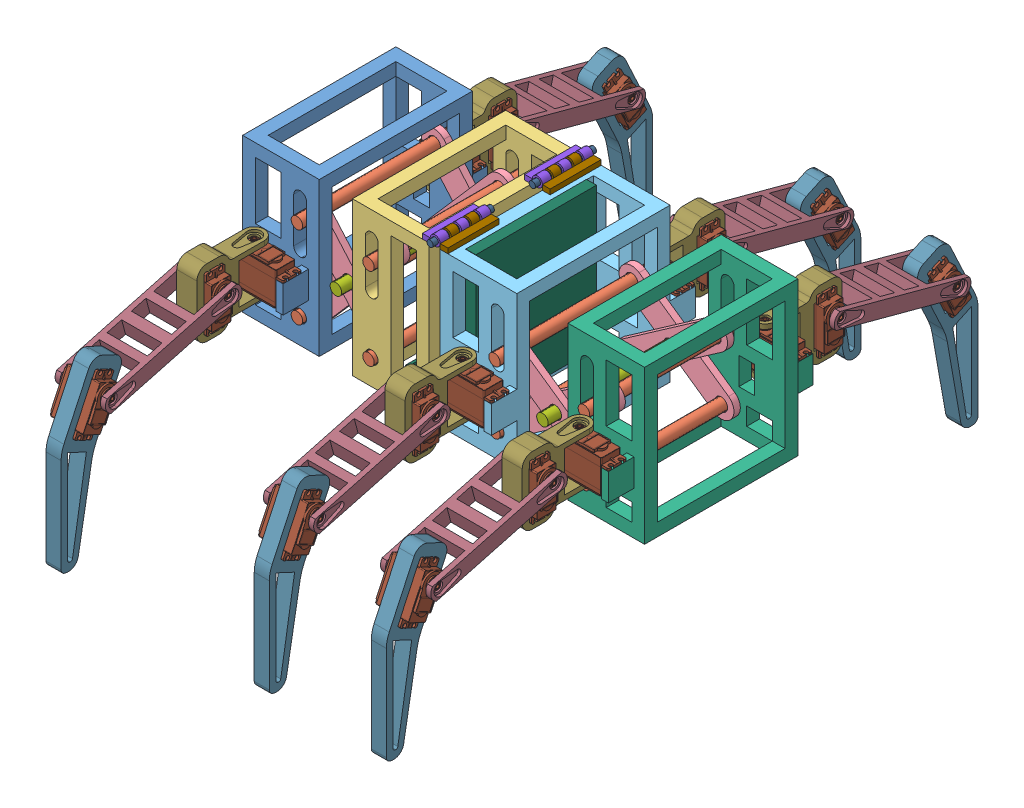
SolidWorks assembly Small-Scale Model Assembly (4-22-21).SLDASM, configuration Default (file format 13000). Lengths in mm.
Overall size (399.66 265.25 667.73).
65 component instances, 15 part files, 181 mates.
Components (placement in the parent):
- Left Body Segment-1: Left Body Segment.SLDPRT [Default] at (-103.1235 37.0795 149.1921) size (76.2 152.4 203.2)
- Shafts for Scissor Lift-1: Shafts for Scissor Lift.SLDPRT [Default] at (-45.9735 144.3276 224.7671) size (11.43 11.43 160)
- Shafts for Scissor Lift-2: Shafts for Scissor Lift.SLDPRT [Default] at (25.1885 144.3276 224.7671) size (11.43 11.43 160)
- Middle Left Body Segment-1: Middle Left Body Segment.SLDPRT [Default] at (6.1385 37.0795 149.1921) size (76.2 152.4 152.4)
- Shafts for Scissor Lift-3: Shafts for Scissor Lift.SLDPRT [Default] at (25.1885 62.4795 224.7671) size (11.43 11.43 160)
- Shafts for Scissor Lift-4: Shafts for Scissor Lift.SLDPRT [Default] at (-45.9735 62.4795 224.7671) size (11.43 11.43 160)
- Arms for Scissor Lift-1: Arms for Scissor Lift.SLDPRT [Default] at (-45.9735 144.3276 282.5421) x (0.656125 -0.754652 0) z (0 0 1) size (133.86 25.4 6.35)
- Arms for Scissor Lift-2: Arms for Scissor Lift.SLDPRT [Default] at (-45.9735 62.4795 276.1921) x (0.656125 0.754652 0) z (0 0 1) size (133.86 25.4 6.35)
- Arms for Scissor Lift-3: Arms for Scissor Lift.SLDPRT [Default] at (-45.9735 144.3276 161.8921) x (0.656125 -0.754652 0) z (0 0 1) size (133.86 25.4 6.35)
- Arms for Scissor Lift-4: Arms for Scissor Lift.SLDPRT [Default] at (-45.9735 62.4795 168.2421) x (0.656125 0.754652 0) z (0 0 1) size (133.86 25.4 6.35)
- Middle right Body Segment-1: Middle right Body Segment.SLDPRT [Default] at (93.3385 37.0795 149.1921) size (76.2 152.4 203.2)
- Right Body Segment-1: Right Body Segment.SLDPRT [Default] at (296.5385 37.0795 301.5921) x (-1 0 0) z (0 0 -1) size (76.2 152.4 203.2)
- Shafts for Scissor Lift-5: Shafts for Scissor Lift.SLDPRT [Default] at (239.3885 62.4795 224.7671) size (11.43 11.43 160)
- Shafts for Scissor Lift-6: Shafts for Scissor Lift.SLDPRT [Default] at (150.4885 62.4795 224.7671) size (11.43 11.43 160)
- Shafts for Scissor Lift-7: Shafts for Scissor Lift.SLDPRT [Default] at (239.3885 124.6078 224.7671) size (11.43 11.43 160)
- Shafts for Scissor Lift-8: Shafts for Scissor Lift.SLDPRT [Default] at (150.4885 124.6078 224.7671) size (11.43 11.43 160)
- Arms for Scissor Lift-5: Arms for Scissor Lift.SLDPRT [Default] at (150.4885 124.6078 282.5421) x (0.819672 -0.572833 0) z (0 0 1) size (133.86 25.4 6.35)
- Arms for Scissor Lift-6: Arms for Scissor Lift.SLDPRT [Default] at (150.4885 62.4795 276.1921) x (0.819672 0.572833 0) z (0 0 1) size (133.86 25.4 6.35)
- Arms for Scissor Lift-7: Arms for Scissor Lift.SLDPRT [Default] at (150.4885 124.6078 161.8921) x (0.819672 -0.572833 0) z (0 0 1) size (133.86 25.4 6.35)
- Arms for Scissor Lift-8: Arms for Scissor Lift.SLDPRT [Default] at (150.4885 62.4795 168.2421) x (0.819672 0.572833 0) z (0 0 1) size (133.86 25.4 6.35)
- Shaft for middle of Scissor Lift-1: Shaft for middle of Scissor Lift.SLDPRT [Default] at (-10.3925 103.4036 151.5921) size (11.43 11.43 150)
- Shaft for middle of Scissor Lift-2: Shaft for middle of Scissor Lift.SLDPRT [Default] at (194.9385 93.5437 151.5921) size (11.43 11.43 150)
- Hinge-1: Hinge.SLDPRT [InnerCuts] at (75.6385 189.4795 276.1921) x (0 1 0) z (0 0 -1) size (10 17.7 50.8)
- Hinge-2: Hinge.SLDPRT [InnerCuts] at (75.6385 189.4795 174.5921) x (0 1 0) z (0 0 -1) size (10 17.7 50.8)
- Hinge 2-1: Hinge 2.SLDPRT [InnerCuts] at (101.0385 189.4795 174.5921) x (0 1 0) z (0 0 1) size (10 17.7 50.8)
- Hinge 2-2: Hinge 2.SLDPRT [InnerCuts] at (101.0385 189.4795 276.1921) x (0 1 0) z (0 0 1) size (10 17.7 50.8)
- Hinge Pin-1: Hinge Pin.SLDPRT [Default] at (88.3385 194.4795 276.2721) size (6.3 6.3 60.8)
- Hinge Pin-2: Hinge Pin.SLDPRT [Default] at (88.3385 194.4795 174.6721) size (6.3 6.3 60.8)
- servo-1: servo.SLDPRT [Default] at (149.3772 57.1295 133.5765) x (1 0 0) z (0 1 0) size (54 19 42.15)
- servo-2: servo.SLDPRT [Default] at (-57.6598 57.1295 317.7765) x (1 0 0) z (0 1 0) size (54 19 42.15)
- servo-3: servo.SLDPRT [Default] at (91.3885 93.2408 83.0265) x (0 -1 0) z (1 0 0) size (54 19 42.15)
- servo-4: servo.SLDPRT [Default] at (207.8135 93.2408 83.0265) x (0 -1 0) z (1 0 0) size (54 19 42.15)
- servo-5: servo.SLDPRT [Default] at (-115.6485 93.2408 83.0265) x (0 -1 0) z (1 0 0) size (54 19 42.15)
- servo-6: servo.SLDPRT [Default] at (207.8135 93.2408 368.3265) x (0 -1 0) z (1 0 0) size (54 19 42.15)
- servo-7: servo.SLDPRT [Default] at (-57.6598 57.1295 133.5765) x (1 0 0) z (0 1 0) size (54 19 42.15)
- servo-8: servo.SLDPRT [Default] at (265.8022 57.1295 133.5765) x (1 0 0) z (0 1 0) size (54 19 42.15)
- servo-9: servo.SLDPRT [Default] at (149.3772 57.1295 317.7765) x (1 0 0) z (0 1 0) size (54 19 42.15)
- servo-10: servo.SLDPRT [Default] at (265.8022 57.1295 317.7765) x (1 0 0) z (0 1 0) size (54 19 42.15)
- Segment 1-1: Segment 1.SLDPRT [Default] at (237.7635 100.6045 349.9921) x (0 -1 0) z (1 0 0) size (67 77 20)
- Segment 1-2: Segment 1.SLDPRT [Default] at (-65.6985 100.6045 100.7921) x (0 -1 0) z (-1 0 0) size (67 77 20)
- Segment 1-3: Segment 1.SLDPRT [Default] at (-85.6985 100.6045 349.9921) x (0 -1 0) z (1 0 0) size (67 77 20)
- Segment 1-4: Segment 1.SLDPRT [Default] at (141.3385 100.6045 100.7921) x (0 -1 0) z (-1 0 0) size (67 77 20)
- Segment 1-5: Segment 1.SLDPRT [Default] at (121.3385 100.6045 349.9921) x (0 -1 0) z (1 0 0) size (67 77 20)
- Segment 1-6: Segment 1.SLDPRT [Default] at (257.7635 100.6045 100.7921) x (0 -1 0) z (-1 0 0) size (67 77 20)
- servo-11: servo.SLDPRT [Default] at (91.3885 93.2408 368.3265) x (0 -1 0) z (1 0 0) size (54 19 42.15)
- servo-12: servo.SLDPRT [Default] at (-115.6485 93.2408 368.3265) x (0 -1 0) z (1 0 0) size (54 19 42.15)
- Segment 2-1: Segment 2.SLDPRT [Default] at (-72.1735 88.5059 424.0565) x (1 0 0) z (0 0.965926 0.258819) size (50.02 140 15)
- Segment 2-2: Segment 2.SLDPRT [Default] at (134.8635 88.5059 424.0565) x (1 0 0) z (0 0.965926 0.258819) size (50.02 140 15)
- Segment 2-3: Segment 2.SLDPRT [Default] at (251.2885 88.5059 424.0565) x (1 0 0) z (0 0.965926 0.258819) size (50.02 140 15)
- Segment 2-4: Segment 2.SLDPRT [Default] at (-72.1735 102.9948 22.8454) x (1 0 0) z (0 -0.965926 0.258819) size (50.02 140 15)
- Segment 2-5: Segment 2.SLDPRT [Default] at (134.8635 102.9948 22.8454) x (1 0 0) z (0 -0.965926 0.258819) size (50.02 140 15)
- Segment 2-6: Segment 2.SLDPRT [Default] at (251.2885 102.9948 22.8454) x (1 0 0) z (0 -0.965926 0.258819) size (50.02 140 15)
- servo-17: servo.SLDPRT [Default] at (91.3885 63.9928 491.8345) x (0 -0.906308 0.422618) z (1 0 0) size (54 19 42.15)
- servo-18: servo.SLDPRT [Default] at (-115.6485 63.9928 491.8345) x (0 -0.906308 0.422618) z (1 0 0) size (54 19 42.15)
- servo-19: servo.SLDPRT [Default] at (207.8135 63.7524 -40.5347) x (0 -0.906308 -0.422618) z (1 0 0) size (54 19 42.15)
- servo-20: servo.SLDPRT [Default] at (91.3885 63.7524 -40.5347) x (0 -0.906308 -0.422618) z (1 0 0) size (54 19 42.15)
- servo-21: servo.SLDPRT [Default] at (207.8135 63.9928 491.8345) x (0 -0.906308 0.422618) z (1 0 0) size (54 19 42.15)
- servo-22: servo.SLDPRT [Default] at (-115.6485 63.7524 -40.5347) x (0 -0.906308 -0.422618) z (1 0 0) size (54 19 42.15)
- Segment 3-1: Segment 3.SLDPRT [Default] at (-80.6985 70.2294 487.7849) x (0 -0.422618 -0.906308) z (1 0 0) size (57.13 169.08 15)
- Segment 3-2: Segment 3.SLDPRT [Default] at (126.3385 70.2294 487.7849) x (0 -0.422618 -0.906308) z (1 0 0) size (57.13 169.08 15)
- Segment 3-3: Segment 3.SLDPRT [Default] at (242.7635 70.2294 487.7849) x (0 -0.422618 -0.906308) z (1 0 0) size (57.13 169.08 15)
- Segment 3-4: Segment 3.SLDPRT [Default] at (257.7635 70.2294 -37.0007) x (0 -0.422618 0.906308) z (-1 0 0) size (57.13 169.08 15)
- Segment 3-5: Segment 3.SLDPRT [Default] at (141.3385 70.2294 -37.0007) x (0 -0.422618 0.906308) z (-1 0 0) size (57.13 169.08 15)
- Segment 3-6: Segment 3.SLDPRT [Default] at (-65.6985 70.2294 -37.0007) x (0 -0.422618 0.906308) z (-1 0 0) size (57.13 169.08 15)
- Arduino and breadboard mount-1: Arduino and breadboard mount.SLDPRT [Default] at (116.0385 49.7795 168.8921) x (0 0 1) z (-1 0 0) size (120 140 70)
Mates (geometry in assembly coordinates):
- Slot1: slot anti-aligned: cylinder of Shafts for Scissor Lift-1 through (-45.9735 144.3276 304.7671) axis (0 0 -1) radius 5.715; plane of Left Body Segment-1 through (-52.3235 164.0795 123.7921) normal (1 0 0); cylinder of Left Body Segment-1 through (-45.9735 164.0795 123.7921) axis (0 0 1) radius 6.35
- Distance1: distance = 3.175 mm aligned: plane of Shafts for Scissor Lift-1 through (-45.9735 144.3276 304.7671) normal (0 0 1); plane of Left Body Segment-1 through (-103.1235 37.0795 301.5921) normal (0 0 1)
- Slot2: slot anti-aligned: cylinder of Shafts for Scissor Lift-2 through (25.1885 144.3276 304.7671) axis (0 0 -1) radius 5.715; plane of Middle Left Body Segment-1 through (18.8385 164.0795 149.1921) normal (1 0 0); cylinder of Middle Left Body Segment-1 through (25.1885 164.0795 149.1921) axis (0 0 1) radius 6.35
- Distance2: distance = 3.175 mm aligned: plane of Middle Left Body Segment-1 through (6.1385 37.0795 301.5921) normal (0 0 1); plane of Shafts for Scissor Lift-2 through (25.1885 144.3276 304.7671) normal (0 0 1)
- Coincident1: coincident aligned: plane of Left Body Segment-1 through (-103.1235 37.0795 301.5921) normal (0 0 1); plane of Middle Left Body Segment-1 through (6.1385 37.0795 301.5921) normal (0 0 1)
- Coincident2: coincident aligned: plane of Left Body Segment-1 through (-103.1235 189.4795 301.5921) normal (0 1 0); plane of Middle Left Body Segment-1 through (6.1385 189.4795 301.5921) normal (0 1 0)
- Coincident3: coincident anti-aligned: line of Left Body Segment-1 through (-45.9735 62.4795 288.8921) axis (0 0 1); line of Shafts for Scissor Lift-4 through (-45.9735 62.4795 304.7671) axis (0 0 -1)
- Distance3: distance = 3.175 mm aligned: plane of Shafts for Scissor Lift-4 through (-45.9735 62.4795 304.7671) normal (0 0 1); plane of Left Body Segment-1 through (-103.1235 37.0795 301.5921) normal (0 0 1)
- Coincident5: coincident anti-aligned: line of Middle Left Body Segment-1 through (25.1885 62.4795 288.8921) axis (0 0 1); line of Shafts for Scissor Lift-3 through (25.1885 62.4795 304.7671) axis (0 0 -1)
- Distance4: distance = 3.175 mm aligned: plane of Shafts for Scissor Lift-3 through (25.1885 62.4795 304.7671) normal (0 0 1); plane of Middle Left Body Segment-1 through (6.1385 37.0795 301.5921) normal (0 0 1)
- Coincident7: coincident aligned: line of Shafts for Scissor Lift-1 through (-45.9735 144.3276 304.7671) axis (0 0 -1); line of Arms for Scissor Lift-1 through (-45.9735 144.3276 288.8921) axis (0 0 -1)
- Coincident8: coincident aligned: line of Shafts for Scissor Lift-3 through (25.1885 62.4795 304.7671) axis (0 0 -1); line of Arms for Scissor Lift-1 through (25.1885 62.4795 288.8921) axis (0 0 -1)
- Coincident9: coincident anti-aligned: plane of Left Body Segment-1 through (-90.4235 37.0795 288.8921) normal (0 0 -1); plane of Arms for Scissor Lift-1 through (-45.9735 144.3276 288.8921) normal (0 0 1)
- Coincident10: coincident aligned: line of Shafts for Scissor Lift-1 through (-45.9735 144.3276 304.7671) axis (0 0 -1); line of Arms for Scissor Lift-3 through (-45.9735 144.3276 168.2421) axis (0 0 -1)
- Coincident11: coincident aligned: line of Shafts for Scissor Lift-3 through (25.1885 62.4795 304.7671) axis (0 0 -1); line of Arms for Scissor Lift-3 through (25.1885 62.4795 168.2421) axis (0 0 -1)
- Coincident12: coincident anti-aligned: plane of Middle Left Body Segment-1 through (18.8385 37.0795 161.8921) normal (0 0 1); plane of Arms for Scissor Lift-3 through (-45.9735 144.3276 161.8921) normal (0 0 -1)
- Coincident13: coincident aligned: line of Shafts for Scissor Lift-2 through (25.1885 144.3276 304.7671) axis (0 0 -1); line of Arms for Scissor Lift-2 through (25.1885 144.3276 282.5421) axis (0 0 -1)
- Coincident14: coincident aligned: line of Shafts for Scissor Lift-4 through (-45.9735 62.4795 304.7671) axis (0 0 -1); line of Arms for Scissor Lift-2 through (-45.9735 62.4795 282.5421) axis (0 0 -1)
- Coincident15: coincident anti-aligned: plane of Arms for Scissor Lift-1 through (-45.9735 144.3276 282.5421) normal (0 0 -1); plane of Arms for Scissor Lift-2 through (-45.9735 62.4795 282.5421) normal (0 0 1)
- Coincident16: coincident aligned: line of Shafts for Scissor Lift-2 through (25.1885 144.3276 304.7671) axis (0 0 -1); line of Arms for Scissor Lift-4 through (25.1885 144.3276 174.5921) axis (0 0 -1)
- Coincident17: coincident aligned: line of Shafts for Scissor Lift-4 through (-45.9735 62.4795 304.7671) axis (0 0 -1); line of Arms for Scissor Lift-4 through (-45.9735 62.4795 174.5921) axis (0 0 -1)
- Coincident18: coincident anti-aligned: plane of Arms for Scissor Lift-3 through (-45.9735 144.3276 168.2421) normal (0 0 1); plane of Arms for Scissor Lift-4 through (-45.9735 62.4795 168.2421) normal (0 0 -1)
- Coincident19: coincident aligned: plane of Middle Left Body Segment-1 through (6.1385 37.0795 301.5921) normal (0 0 1); plane of Middle right Body Segment-1 through (93.3385 37.0795 301.5921) normal (0 0 1)
- Coincident20: coincident aligned: plane of Middle right Body Segment-1 through (93.3385 37.0795 301.5921) normal (0 0 1); plane of Right Body Segment-1 through (296.5385 37.0795 301.5921) normal (0 0 1)
- Coincident21: coincident aligned: plane of Middle right Body Segment-1 through (93.3385 189.4795 301.5921) normal (0 1 0); plane of Right Body Segment-1 through (296.5385 189.4795 149.1921) normal (0 1 0)
- Slot3: slot aligned: cylinder of Shafts for Scissor Lift-7 through (239.3885 124.6078 304.7671) axis (0 0 -1) radius 5.715; plane of Right Body Segment-1 through (233.0385 164.0795 326.9921) normal (1 0 0); cylinder of Right Body Segment-1 through (239.3885 119.6295 326.9921) axis (0 0 -1) radius 6.35
- Distance5: distance = 3.175 mm aligned: plane of Shafts for Scissor Lift-7 through (239.3885 124.6078 304.7671) normal (0 0 1); plane of Right Body Segment-1 through (296.5385 37.0795 301.5921) normal (0 0 1)
- Coincident22: coincident aligned: line of Right Body Segment-1 through (239.3885 62.4795 301.5921) axis (0 0 -1); line of Shafts for Scissor Lift-5 through (239.3885 62.4795 304.7671) axis (0 0 -1)
- Distance6: distance = 3.175 mm aligned: plane of Right Body Segment-1 through (296.5385 37.0795 301.5921) normal (0 0 1); plane of Shafts for Scissor Lift-5 through (239.3885 62.4795 304.7671) normal (0 0 1)
- Slot4: slot anti-aligned: cylinder of Shafts for Scissor Lift-8 through (150.4885 124.6078 304.7671) axis (0 0 -1) radius 5.715; plane of Middle right Body Segment-1 through (144.1385 164.0795 123.7921) normal (1 0 0); cylinder of Middle right Body Segment-1 through (150.4885 164.0795 123.7921) axis (0 0 1) radius 6.35
- Distance7: distance = 3.175 mm aligned: plane of Middle right Body Segment-1 through (93.3385 37.0795 301.5921) normal (0 0 1); plane of Shafts for Scissor Lift-8 through (150.4885 124.6078 304.7671) normal (0 0 1)
- Coincident24: coincident anti-aligned: line of Middle right Body Segment-1 through (150.4885 62.4795 288.8921) axis (0 0 1); line of Shafts for Scissor Lift-6 through (150.4885 62.4795 304.7671) axis (0 0 -1)
- Distance8: distance = 3.175 mm aligned: plane of Shafts for Scissor Lift-6 through (150.4885 62.4795 304.7671) normal (0 0 1); plane of Middle right Body Segment-1 through (93.3385 37.0795 301.5921) normal (0 0 1)
- Coincident26: coincident aligned: line of Shafts for Scissor Lift-8 through (150.4885 124.6078 304.7671) axis (0 0 -1); line of Arms for Scissor Lift-5 through (150.4885 124.6078 288.8921) axis (0 0 -1)
- Coincident27: coincident aligned: line of Shafts for Scissor Lift-5 through (239.3885 62.4795 304.7671) axis (0 0 -1); line of Arms for Scissor Lift-5 through (239.3885 62.4795 288.8921) axis (0 0 -1)
- Coincident28: coincident anti-aligned: plane of Middle right Body Segment-1 through (106.0385 37.0795 288.8921) normal (0 0 -1); plane of Arms for Scissor Lift-5 through (150.4885 124.6078 288.8921) normal (0 0 1)
- Coincident29: coincident aligned: line of Shafts for Scissor Lift-8 through (150.4885 124.6078 304.7671) axis (0 0 -1); line of Arms for Scissor Lift-7 through (150.4885 124.6078 168.2421) axis (0 0 -1)
- Coincident30: coincident aligned: line of Shafts for Scissor Lift-5 through (239.3885 62.4795 304.7671) axis (0 0 -1); line of Arms for Scissor Lift-7 through (239.3885 62.4795 168.2421) axis (0 0 -1)
- Coincident31: coincident anti-aligned: plane of Right Body Segment-1 through (283.8385 37.0795 161.8921) normal (0 0 1); plane of Arms for Scissor Lift-7 through (150.4885 124.6078 161.8921) normal (0 0 -1)
- Coincident32: coincident aligned: line of Shafts for Scissor Lift-7 through (239.3885 124.6078 304.7671) axis (0 0 -1); line of Arms for Scissor Lift-8 through (239.3885 124.6078 174.5921) axis (0 0 -1)
- Coincident33: coincident aligned: line of Shafts for Scissor Lift-6 through (150.4885 62.4795 304.7671) axis (0 0 -1); line of Arms for Scissor Lift-8 through (150.4885 62.4795 174.5921) axis (0 0 -1)
- Coincident34: coincident anti-aligned: plane of Arms for Scissor Lift-7 through (150.4885 124.6078 168.2421) normal (0 0 1); plane of Arms for Scissor Lift-8 through (150.4885 62.4795 168.2421) normal (0 0 -1)
- Coincident35: coincident aligned: line of Shafts for Scissor Lift-7 through (239.3885 124.6078 304.7671) axis (0 0 -1); line of Arms for Scissor Lift-6 through (239.3885 124.6078 282.5421) axis (0 0 -1)
- Coincident36: coincident aligned: line of Shafts for Scissor Lift-6 through (150.4885 62.4795 304.7671) axis (0 0 -1); line of Arms for Scissor Lift-6 through (150.4885 62.4795 282.5421) axis (0 0 -1)
- Coincident37: coincident anti-aligned: plane of Arms for Scissor Lift-5 through (150.4885 124.6078 282.5421) normal (0 0 -1); plane of Arms for Scissor Lift-6 through (150.4885 62.4795 282.5421) normal (0 0 1)
- Coincident38: coincident aligned: line of Arms for Scissor Lift-1 through (-10.3925 103.4036 288.8921) axis (0 0 -1); line of Shaft for middle of Scissor Lift-1 through (-10.3925 103.4036 301.5921) axis (0 0 -1)
- Coincident39: coincident aligned: plane of Left Body Segment-1 through (-103.1235 37.0795 301.5921) normal (0 0 1); plane of Shaft for middle of Scissor Lift-1 through (-10.3925 103.4036 301.5921) normal (0 0 1)
- Coincident40: coincident aligned: line of Arms for Scissor Lift-5 through (194.9385 93.5437 288.8921) axis (0 0 -1); line of Shaft for middle of Scissor Lift-2 through (194.9385 93.5437 301.5921) axis (0 0 -1)
- Coincident41: coincident aligned: plane of Middle right Body Segment-1 through (93.3385 37.0795 301.5921) normal (0 0 1); plane of Shaft for middle of Scissor Lift-2 through (194.9385 93.5437 301.5921) normal (0 0 1)
- Coincident43: coincident anti-aligned: plane of Middle Left Body Segment-1 through (6.1385 189.4795 301.5921) normal (0 1 0); plane of Hinge-2 through (75.6385 189.4795 149.1921) normal (0 -1 0)
- Coincident44: coincident aligned: plane of Middle Left Body Segment-1 through (82.3385 37.0795 301.5921) normal (1 0 0); plane of Hinge-2 through (82.3385 189.4795 178.6721) normal (1 0 0)
- Coincident45: coincident aligned: plane of Middle Left Body Segment-1 through (6.1385 37.0795 149.1921) normal (0 0 -1); plane of Hinge-2 through (75.6385 189.4795 149.1921) normal (0 0 -1)
- Coincident46: coincident anti-aligned: plane of Middle Left Body Segment-1 through (6.1385 189.4795 301.5921) normal (0 1 0); plane of Hinge-1 through (75.6385 189.4795 250.7921) normal (0 -1 0)
- Coincident47: coincident aligned: plane of Middle Left Body Segment-1 through (82.3385 37.0795 301.5921) normal (1 0 0); plane of Hinge-1 through (82.3385 189.4795 280.2721) normal (1 0 0)
- Coincident48: coincident aligned: plane of Middle Left Body Segment-1 through (6.1385 37.0795 301.5921) normal (0 0 1); plane of Hinge-1 through (75.6385 189.4795 301.5921) normal (0 0 1)
- Coincident49: coincident anti-aligned: plane of Middle right Body Segment-1 through (93.3385 189.4795 301.5921) normal (0 1 0); plane of Hinge 2-2 through (101.0385 189.4795 301.5921) normal (0 -1 0)
- Coincident50: coincident aligned: plane of Middle right Body Segment-1 through (93.3385 37.0795 301.5921) normal (-1 0 0); plane of Hinge 2-2 through (93.3385 189.4795 276.1921) normal (-1 0 0)
- Coincident51: coincident aligned: plane of Middle right Body Segment-1 through (93.3385 37.0795 301.5921) normal (0 0 1); plane of Hinge 2-2 through (101.0385 189.4795 301.5921) normal (0 0 1)
- Coincident52: coincident anti-aligned: plane of Middle right Body Segment-1 through (93.3385 189.4795 301.5921) normal (0 1 0); plane of Hinge 2-1 through (101.0385 189.4795 199.9921) normal (0 -1 0)
- Coincident53: coincident aligned: plane of Middle right Body Segment-1 through (93.3385 37.0795 301.5921) normal (-1 0 0); plane of Hinge 2-1 through (93.3385 189.4795 174.5921) normal (-1 0 0)
- Coincident54: coincident aligned: plane of Middle right Body Segment-1 through (93.3385 37.0795 149.1921) normal (0 0 -1); plane of Hinge 2-1 through (101.0385 189.4795 149.1921) normal (0 0 -1)
- Coincident55: coincident anti-aligned: line of Hinge-1 through (88.3385 194.4795 292.4321) axis (0 0 1); line of Hinge 2-2 through (88.3385 194.4795 290.4321) axis (0 0 -1)
- Coincident56: coincident anti-aligned: line of Hinge-2 through (88.3385 194.4795 190.8321) axis (0 0 1); line of Hinge 2-1 through (88.3385 194.4795 188.8321) axis (0 0 -1)
- Coincident57: coincident anti-aligned: line of Hinge-1 through (88.3385 194.4795 292.4321) axis (0 0 1); line of Hinge Pin-1 through (88.3385 194.4795 306.6721) axis (0 0 -1)
- Distance9: distance = 5.08 mm aligned: plane of Hinge-1 through (75.6385 189.4795 301.5921) normal (0 0 1); plane of Hinge Pin-1 through (88.3385 194.4795 306.6721) normal (0 0 1)
- Coincident59: coincident anti-aligned: line of Hinge-2 through (88.3385 194.4795 190.8321) axis (0 0 1); line of Hinge Pin-2 through (88.3385 194.4795 205.0721) axis (0 0 -1)
- Distance10: distance = 5.08 mm aligned: plane of Hinge-2 through (75.6385 189.4795 199.9921) normal (0 0 1); plane of Hinge Pin-2 through (88.3385 194.4795 205.0721) normal (0 0 1)
- LimitAngle1: limit planar angle anti-aligned: plane of Middle Left Body Segment-1 through (82.3385 37.0795 301.5921) normal (1 0 0); plane of Middle right Body Segment-1 through (93.3385 37.0795 301.5921) normal (-1 0 0)
- LimitDistance1: limit distance = 33.062 mm anti-aligned: plane of Left Body Segment-1 through (-26.9235 37.0795 301.5921) normal (1 0 0); plane of Middle Left Body Segment-1 through (6.1385 37.0795 301.5921) normal (-1 0 0)
- LimitDistance2: limit distance = 50.8 mm anti-aligned: plane of Middle right Body Segment-1 through (169.5385 37.0795 301.5921) normal (1 0 0); plane of Right Body Segment-1 through (220.3385 37.0795 149.1921) normal (-1 0 0)
- Coincident63: coincident anti-aligned: plane of Right Body Segment-1 through (278.9635 107.0795 326.9921) normal (-1 0 0); plane of servo-10 through (278.9635 107.0795 325.9921) normal (1 0 0)
- Coincident64: coincident aligned: plane of Right Body Segment-1 through (296.5385 37.0795 326.9921) normal (0 0 1); plane of servo-10 through (239.4635 107.0795 326.9921) normal (0 0 1)
- Coincident65: coincident anti-aligned: plane of Right Body Segment-1 through (237.9135 107.0795 326.9921) normal (0 1 0); plane of servo-10 through (247.9635 107.0795 317.4921) normal (0 -1 0)
- Coincident66: coincident anti-aligned: plane of Middle right Body Segment-1 through (162.5385 107.0795 326.9921) normal (-1 0 0); plane of servo-9 through (162.5385 107.0795 325.9921) normal (1 0 0)
- Coincident67: coincident aligned: plane of Middle right Body Segment-1 through (93.3385 37.0795 326.9921) normal (0 0 1); plane of servo-9 through (123.0385 107.0795 326.9921) normal (0 0 1)
- Coincident68: coincident anti-aligned: plane of Middle right Body Segment-1 through (121.4885 107.0795 326.9921) normal (0 1 0); plane of servo-9 through (131.5385 107.0795 317.4921) normal (0 -1 0)
- Coincident69: coincident anti-aligned: plane of Left Body Segment-1 through (-44.4985 107.0795 326.9921) normal (-1 0 0); plane of servo-2 through (-44.4985 107.0795 325.9921) normal (1 0 0)
- Coincident70: coincident aligned: plane of Left Body Segment-1 through (-103.1235 37.0795 326.9921) normal (0 0 1); plane of servo-2 through (-83.9985 107.0795 326.9921) normal (0 0 1)
- Coincident73: coincident anti-aligned: plane of Left Body Segment-1 through (-92.5485 107.0795 326.9921) normal (0 1 0); plane of servo-2 through (-75.4985 107.0795 317.4921) normal (0 -1 0)
- Coincident74: coincident anti-aligned: plane of Right Body Segment-1 through (278.9635 107.0795 123.7921) normal (-1 0 0); plane of servo-8 through (278.9635 107.0795 141.7921) normal (1 0 0)
- Coincident75: coincident aligned: plane of Right Body Segment-1 through (296.5385 37.0795 123.7921) normal (0 0 -1); plane of servo-8 through (277.9635 107.0795 123.7921) normal (0 0 -1)
- Coincident76: coincident anti-aligned: plane of Right Body Segment-1 through (285.9635 107.0795 123.7921) normal (0 1 0); plane of servo-8 through (247.9635 107.0795 133.2921) normal (0 -1 0)
- Coincident77: coincident anti-aligned: plane of Middle right Body Segment-1 through (162.5385 107.0795 123.7921) normal (-1 0 0); plane of servo-1 through (162.5385 107.0795 141.7921) normal (1 0 0)
- Coincident78: coincident aligned: plane of Middle right Body Segment-1 through (93.3385 37.0795 123.7921) normal (0 0 -1); plane of servo-1 through (161.5385 107.0795 123.7921) normal (0 0 -1)
- Coincident79: coincident anti-aligned: plane of Middle right Body Segment-1 through (162.5385 107.0795 123.7921) normal (0 1 0); plane of servo-1 through (131.5385 107.0795 133.2921) normal (0 -1 0)
- Coincident80: coincident anti-aligned: plane of Left Body Segment-1 through (-44.4985 107.0795 123.7921) normal (-1 0 0); plane of servo-7 through (-44.4985 107.0795 141.7921) normal (1 0 0)
- Coincident81: coincident aligned: plane of Left Body Segment-1 through (-103.1235 37.0795 123.7921) normal (0 0 -1); plane of servo-7 through (-45.4985 107.0795 123.7921) normal (0 0 -1)
- Coincident82: coincident anti-aligned: plane of Left Body Segment-1 through (-44.4985 107.0795 123.7921) normal (0 1 0); plane of servo-7 through (-75.4985 107.0795 133.2921) normal (0 -1 0)
- Coincident83: coincident: line of assembly; axis of servo-10 through (247.7635 114.8853 317.4921) axis (0 1 0); axis of Segment 1-1 through (247.7635 120.6295 317.4921) axis (0 1 0)
- Coincident84: coincident anti-aligned: plane of servo-10 through (277.9635 80.5795 308.9921) normal (0 -1 0); plane of Segment 1-1 through (237.7635 80.5795 307.4921) normal (0 1 0)
- Angle3: planar angle anti-aligned: plane of servo-10 through (239.4635 107.0795 326.9921) normal (0 0 1); plane of Segment 1-1 through (237.7635 120.6295 342.4921) normal (0 0 -1)
- Coincident86: coincident: line of assembly; axis of servo-9 through (131.3385 114.8853 317.4921) axis (0 1 0); axis of Segment 1-5 through (131.3385 120.6295 317.4921) axis (0 1 0)
- Coincident87: coincident anti-aligned: plane of servo-9 through (161.5385 80.5795 308.9921) normal (0 -1 0); plane of Segment 1-5 through (121.3385 80.5795 307.4921) normal (0 1 0)
- Angle4: planar angle anti-aligned: plane of servo-9 through (123.0385 107.0795 326.9921) normal (0 0 1); plane of Segment 1-5 through (121.3385 120.6295 342.4921) normal (0 0 -1)
- Coincident89: coincident: line of assembly; axis of servo-2 through (-75.6985 114.8853 317.4921) axis (0 1 0); axis of Segment 1-3 through (-75.6985 120.6295 317.4921) axis (0 1 0)
- Coincident90: coincident anti-aligned: plane of servo-2 through (-45.4985 80.5795 308.9921) normal (0 -1 0); plane of Segment 1-3 through (-85.6985 80.5795 307.4921) normal (0 1 0)
- Angle5: planar angle anti-aligned: plane of servo-2 through (-83.9985 107.0795 326.9921) normal (0 0 1); plane of Segment 1-3 through (-85.6985 120.6295 342.4921) normal (0 0 -1)
- Coincident92: coincident: line of assembly; axis of servo-8 through (247.7635 114.8853 133.2921) axis (0 1 0); axis of Segment 1-6 through (247.7635 120.6295 133.2921) axis (0 1 0)
- Coincident93: coincident anti-aligned: plane of servo-8 through (277.9635 80.5795 124.7921) normal (0 -1 0); plane of Segment 1-6 through (257.7635 80.5795 143.2921) normal (0 1 0)
- Angle6: planar angle anti-aligned: plane of servo-8 through (277.9635 107.0795 123.7921) normal (0 0 -1); plane of Segment 1-6 through (257.7635 120.6295 108.2921) normal (0 0 1)
- Coincident95: coincident: line of assembly; axis of servo-1 through (131.3385 114.8853 133.2921) axis (0 1 0); axis of Segment 1-4 through (131.3385 120.6295 133.2921) axis (0 1 0)
- Coincident96: coincident anti-aligned: plane of servo-1 through (161.5385 80.5795 124.7921) normal (0 -1 0); plane of Segment 1-4 through (141.3385 80.5795 143.2921) normal (0 1 0)
- Angle7: planar angle anti-aligned: plane of servo-1 through (161.5385 107.0795 123.7921) normal (0 0 -1); plane of Segment 1-4 through (141.3385 120.6295 108.2921) normal (0 0 1)
- Coincident98: coincident: line of assembly; axis of servo-7 through (-75.6985 114.8853 133.2921) axis (0 1 0); axis of Segment 1-2 through (-75.6985 120.6295 133.2921) axis (0 1 0)
- Coincident99: coincident anti-aligned: plane of servo-7 through (-45.4985 80.5795 124.7921) normal (0 -1 0); plane of Segment 1-2 through (-65.6985 80.5795 143.2921) normal (0 1 0)
- Angle8: planar angle anti-aligned: plane of servo-7 through (-45.4985 107.0795 123.7921) normal (0 0 -1); plane of Segment 1-2 through (-65.6985 120.6295 108.2921) normal (0 0 1)
- Coincident101: coincident anti-aligned: plane of Segment 1-3 through (-85.6985 121.1295 377.5421) normal (0 0 -1); plane of servo-12 through (-65.6985 119.5795 377.5421) normal (0 0 1)
- Coincident102: coincident anti-aligned: plane of Segment 1-3 through (-85.6985 80.0795 377.5421) normal (0 1 0); plane of servo-12 through (-65.6985 80.0795 376.5421) normal (0 -1 0)
- Coincident103: coincident anti-aligned: plane of Segment 1-3 through (-65.6985 100.6045 349.9921) normal (1 0 0); plane of servo-12 through (-65.6985 111.0795 368.0421) normal (-1 0 0)
- Coincident104: coincident anti-aligned: plane of Segment 1-5 through (121.3385 121.1295 377.5421) normal (0 0 -1); plane of servo-11 through (141.3385 119.5795 377.5421) normal (0 0 1)
- Coincident105: coincident anti-aligned: plane of Segment 1-5 through (121.3385 80.0795 377.5421) normal (0 1 0); plane of servo-11 through (141.3385 80.0795 376.5421) normal (0 -1 0)
- Coincident106: coincident anti-aligned: plane of Segment 1-5 through (141.3385 100.6045 349.9921) normal (1 0 0); plane of servo-11 through (141.3385 111.0795 368.0421) normal (-1 0 0)
- Coincident107: coincident anti-aligned: plane of servo-6 through (257.7635 119.5795 377.5421) normal (0 0 1); plane of Segment 1-1 through (237.7635 121.1295 377.5421) normal (0 0 -1)
- Coincident108: coincident anti-aligned: plane of servo-6 through (257.7635 80.0795 376.5421) normal (0 -1 0); plane of Segment 1-1 through (237.7635 80.0795 377.5421) normal (0 1 0)
- Coincident109: coincident anti-aligned: plane of servo-6 through (257.7635 111.0795 368.0421) normal (-1 0 0); plane of Segment 1-1 through (257.7635 100.6045 349.9921) normal (1 0 0)
- Coincident110: coincident anti-aligned: plane of servo-4 through (257.7635 81.0795 73.2421) normal (0 0 -1); plane of Segment 1-6 through (257.7635 121.1295 73.2421) normal (0 0 1)
- Coincident111: coincident anti-aligned: plane of servo-4 through (257.7635 80.0795 91.2421) normal (0 -1 0); plane of Segment 1-6 through (257.7635 80.0795 73.2421) normal (0 1 0)
- Coincident112: coincident anti-aligned: plane of servo-4 through (257.7635 111.0795 82.7421) normal (-1 0 0); plane of Segment 1-6 through (257.7635 100.6045 100.7921) normal (1 0 0)
- Coincident113: coincident anti-aligned: plane of servo-3 through (141.3385 81.0795 73.2421) normal (0 0 -1); plane of Segment 1-4 through (141.3385 121.1295 73.2421) normal (0 0 1)
- Coincident114: coincident anti-aligned: plane of servo-3 through (141.3385 80.0795 91.2421) normal (0 -1 0); plane of Segment 1-4 through (141.3385 80.0795 73.2421) normal (0 1 0)
- Coincident115: coincident anti-aligned: plane of servo-3 through (141.3385 111.0795 82.7421) normal (-1 0 0); plane of Segment 1-4 through (141.3385 100.6045 100.7921) normal (1 0 0)
- Coincident116: coincident anti-aligned: plane of servo-5 through (-65.6985 81.0795 73.2421) normal (0 0 -1); plane of Segment 1-2 through (-65.6985 121.1295 73.2421) normal (0 0 1)
- Coincident117: coincident anti-aligned: plane of servo-5 through (-65.6985 80.0795 91.2421) normal (0 -1 0); plane of Segment 1-2 through (-65.6985 80.0795 73.2421) normal (0 1 0)
- Coincident118: coincident anti-aligned: plane of servo-5 through (-65.6985 111.0795 82.7421) normal (-1 0 0); plane of Segment 1-2 through (-65.6985 100.6045 100.7921) normal (1 0 0)
- Coincident119: coincident: line of assembly; axis of servo-12 through (-57.8927 111.2795 368.0421) axis (1 0 0); axis of Segment 2-1 through (-52.1485 111.2795 368.0421) axis (1 0 0)
- Coincident120: coincident anti-aligned: plane of servo-12 through (-92.1985 81.0795 359.5421) normal (-1 0 0); plane of Segment 2-1 through (-92.1985 106.6233 356.4417) normal (1 0 0)
- Angle9: planar angle = 0.261799 rad anti-aligned: plane of Segment 1-3 through (-85.6985 138.1045 384.4921) normal (0 0 1); plane of Segment 2-1 through (-92.1985 95.7529 397.0106) normal (0 0.258819 -0.965926)
- Coincident122: coincident: line of servo-11 through (149.1443 111.2795 368.0421) axis (1 0 0); line of Segment 2-2 through (154.8885 111.2795 368.0421) axis (1 0 0)
- Coincident123: coincident anti-aligned: plane of servo-11 through (114.8385 81.0795 359.5421) normal (-1 0 0); plane of Segment 2-2 through (114.8385 106.6233 356.4417) normal (1 0 0)
- Angle10: planar angle = 0.261799 rad anti-aligned: plane of Segment 1-5 through (121.3385 138.1045 384.4921) normal (0 0 1); plane of Segment 2-2 through (114.8385 95.7529 397.0106) normal (0 0.258819 -0.965926)
- Coincident125: coincident: line of servo-6 through (265.5693 111.2795 368.0421) axis (1 0 0); line of Segment 2-3 through (276.301 111.2795 368.0421) axis (-1 0 0)
- Coincident126: coincident anti-aligned: plane of servo-6 through (231.2635 81.0795 359.5421) normal (-1 0 0); plane of Segment 2-3 through (231.2635 106.6233 356.4417) normal (1 0 0)
- Angle11: planar angle = 0.261799 rad anti-aligned: plane of Segment 1-1 through (237.7635 138.1045 384.4921) normal (0 0 1); plane of Segment 2-3 through (231.2635 95.7529 397.0106) normal (0 0.258819 -0.965926)
- Coincident128: coincident: line of servo-4 through (265.5693 111.2795 82.7421) axis (1 0 0); line of Segment 2-6 through (276.301 111.2795 82.7421) axis (-1 0 0)
- Coincident129: coincident anti-aligned: plane of servo-4 through (231.2635 81.0795 74.2421) normal (-1 0 0); plane of Segment 2-6 through (231.2635 121.1122 90.4602) normal (1 0 0)
- Angle12: planar angle = 0.261799 rad anti-aligned: plane of Segment 1-6 through (257.7635 138.1045 66.2921) normal (0 0 -1); plane of Segment 2-6 through (231.2635 110.2418 49.8914) normal (0 0.258819 0.965926)
- Coincident131: coincident: line of servo-3 through (149.1443 111.2795 82.7421) axis (1 0 0); line of Segment 2-5 through (154.8885 111.2795 82.7421) axis (1 0 0)
- Coincident132: coincident anti-aligned: plane of servo-3 through (114.8385 81.0795 74.2421) normal (-1 0 0); plane of Segment 2-5 through (114.8385 121.1122 90.4602) normal (1 0 0)
- Angle13: planar angle = 0.261799 rad anti-aligned: plane of Segment 1-4 through (141.3385 138.1045 66.2921) normal (0 0 -1); plane of Segment 2-5 through (114.8385 110.2418 49.8914) normal (0 0.258819 0.965926)
- Coincident134: coincident: line of servo-5 through (-57.8927 111.2795 82.7421) axis (1 0 0); line of Segment 2-4 through (-47.161 111.2795 82.7421) axis (-1 0 0)
- Coincident135: coincident anti-aligned: plane of servo-5 through (-92.1985 81.0795 74.2421) normal (-1 0 0); plane of Segment 2-4 through (-92.1985 121.1122 90.4602) normal (1 0 0)
- Angle14: planar angle = 0.261799 rad anti-aligned: plane of Segment 1-2 through (-65.6985 138.1045 66.2921) normal (0 0 -1); plane of Segment 2-4 through (-92.1985 110.2418 49.8914) normal (0 0.258819 0.965926)
- Coincident137: coincident anti-aligned: line of Segment 2-1 through (-47.161 80.2212 483.9532) axis (-1 0 0); line of servo-18 through (-57.8927 80.2212 483.9532) axis (1 0 0)
- Coincident138: coincident anti-aligned: plane of Segment 2-1 through (-92.1985 70.3886 491.6713) normal (1 0 0); plane of servo-18 through (-92.1985 49.2585 489.0127) normal (-1 0 0)
- Angle15: planar angle = 5.585054 rad anti-aligned: plane of servo-18 through (-65.6985 48.8359 488.1064) normal (0 -0.422618 -0.906308); plane of Segment 2-1 through (-92.1985 81.259 451.1025) normal (0 -0.258819 0.965926)
- Coincident140: coincident anti-aligned: line of Segment 2-2 through (159.876 80.2212 483.9532) axis (-1 0 0); line of servo-17 through (149.1443 80.2212 483.9532) axis (1 0 0)
- Coincident141: coincident anti-aligned: plane of Segment 2-2 through (114.8385 70.3886 491.6713) normal (1 0 0); plane of servo-17 through (114.8385 49.2585 489.0127) normal (-1 0 0)
- Angle16: planar angle = 0.698132 rad anti-aligned: plane of Segment 2-2 through (114.8385 81.259 451.1025) normal (0 -0.258819 0.965926); plane of servo-17 through (141.3385 48.8359 488.1064) normal (0 -0.422618 -0.906308)
- Coincident143: coincident anti-aligned: line of Segment 2-3 through (276.301 80.2212 483.9532) axis (-1 0 0); line of servo-21 through (265.5693 80.2212 483.9532) axis (1 0 0)
- Coincident144: coincident anti-aligned: plane of Segment 2-3 through (231.2635 70.3886 491.6713) normal (1 0 0); plane of servo-21 through (231.2635 49.2585 489.0127) normal (-1 0 0)
- Angle17: planar angle = 0.698132 rad anti-aligned: plane of Segment 2-3 through (231.2635 81.259 451.1025) normal (0 -0.258819 0.965926); plane of servo-21 through (257.7635 48.8359 488.1064) normal (0 -0.422618 -0.906308)
- Coincident146: coincident anti-aligned: line of Segment 2-6 through (276.301 80.2212 -33.169) axis (-1 0 0); line of servo-19 through (265.5693 80.2212 -33.169) axis (1 0 0)
- Coincident147: coincident anti-aligned: plane of Segment 2-6 through (231.2635 84.8775 -44.7694) normal (1 0 0); plane of servo-19 through (231.2635 56.443 -53.6357) normal (-1 0 0)
- Angle18: planar angle = 0.698132 rad anti-aligned: plane of Segment 2-6 through (231.2635 95.7479 -4.2005) normal (0 -0.258819 -0.965926); plane of servo-19 through (257.7635 83.7287 -21.0513) normal (0 -0.422618 0.906308)
- Coincident149: coincident anti-aligned: line of Segment 2-5 through (159.876 80.2212 -33.169) axis (-1 0 0); line of servo-20 through (149.1443 80.2212 -33.169) axis (1 0 0)
- Coincident150: coincident anti-aligned: plane of Segment 2-5 through (114.8385 84.8775 -44.7694) normal (1 0 0); plane of servo-20 through (114.8385 56.443 -53.6357) normal (-1 0 0)
- Angle19: planar angle = 0.698132 rad anti-aligned: plane of Segment 2-5 through (114.8385 95.7479 -4.2005) normal (0 -0.258819 -0.965926); plane of servo-20 through (141.3385 83.7287 -21.0513) normal (0 -0.422618 0.906308)
- Coincident152: coincident anti-aligned: line of Segment 2-4 through (-47.161 80.2212 -33.169) axis (-1 0 0); line of servo-22 through (-57.8927 80.2212 -33.169) axis (1 0 0)
- Coincident153: coincident anti-aligned: plane of Segment 2-4 through (-92.1985 84.8775 -44.7694) normal (1 0 0); plane of servo-22 through (-92.1985 56.443 -53.6357) normal (-1 0 0)
- Angle20: planar angle = 0.698132 rad anti-aligned: plane of Segment 2-4 through (-92.1985 95.7479 -4.2005) normal (0 -0.258819 -0.965926); plane of servo-22 through (-65.6985 83.7287 -21.0513) normal (0 -0.422618 0.906308)
- Coincident155: coincident anti-aligned: plane of servo-18 through (-65.6985 91.7585 489.0554) normal (0 0.422618 0.906308); plane of Segment 3-1 through (-80.6985 55.9593 505.7488) normal (0 -0.422618 -0.906308)
- Coincident156: coincident anti-aligned: plane of servo-18 through (-65.6985 55.5367 504.8425) normal (0 -0.906308 0.422618); plane of Segment 3-1 through (-80.6985 55.9593 505.7488) normal (0 0.906308 -0.422618)
- Coincident157: coincident anti-aligned: plane of servo-18 through (-65.6985 80.04 484.0377) normal (-1 0 0); plane of Segment 3-1 through (-65.6985 70.2294 487.7849) normal (1 0 0)
- Coincident158: coincident anti-aligned: plane of servo-17 through (141.3385 91.7585 489.0554) normal (0 0.422618 0.906308); plane of Segment 3-2 through (126.3385 55.9593 505.7488) normal (0 -0.422618 -0.906308)
- Coincident159: coincident anti-aligned: plane of servo-17 through (141.3385 55.5367 504.8425) normal (0 -0.906308 0.422618); plane of Segment 3-2 through (126.3385 55.9593 505.7488) normal (0 0.906308 -0.422618)
- Coincident160: coincident anti-aligned: plane of servo-17 through (141.3385 80.04 484.0377) normal (-1 0 0); plane of Segment 3-2 through (141.3385 70.2294 487.7849) normal (1 0 0)
- Coincident161: coincident anti-aligned: plane of servo-21 through (257.7635 91.7585 489.0554) normal (0 0.422618 0.906308); plane of Segment 3-3 through (242.7635 55.9593 505.7488) normal (0 -0.422618 -0.906308)
- Coincident162: coincident anti-aligned: plane of servo-21 through (257.7635 55.5367 504.8425) normal (0 -0.906308 0.422618); plane of Segment 3-3 through (242.7635 55.9593 505.7488) normal (0 0.906308 -0.422618)
- Coincident163: coincident anti-aligned: plane of servo-21 through (257.7635 80.04 484.0377) normal (-1 0 0); plane of Segment 3-3 through (257.7635 70.2294 487.7849) normal (1 0 0)
- Coincident164: coincident anti-aligned: plane of servo-19 through (257.7635 56.8656 -54.542) normal (0 0.422618 -0.906308); plane of Segment 3-4 through (257.7635 55.9593 -54.9646) normal (0 -0.422618 0.906308)
- Coincident165: coincident anti-aligned: plane of servo-19 through (257.7635 48.3522 -38.651) normal (0 -0.906308 -0.422618); plane of Segment 3-4 through (257.7635 55.9593 -54.9646) normal (0 0.906308 0.422618)
- Coincident166: coincident anti-aligned: plane of servo-19 through (257.7635 80.04 -33.2535) normal (-1 0 0); plane of Segment 3-4 through (257.7635 70.2294 -37.0007) normal (1 0 0)
- Coincident167: coincident anti-aligned: plane of servo-20 through (141.3385 56.8656 -54.542) normal (0 0.422618 -0.906308); plane of Segment 3-5 through (141.3385 55.9593 -54.9646) normal (0 -0.422618 0.906308)
- Coincident168: coincident anti-aligned: plane of servo-20 through (141.3385 48.3522 -38.651) normal (0 -0.906308 -0.422618); plane of Segment 3-5 through (141.3385 55.9593 -54.9646) normal (0 0.906308 0.422618)
- Coincident169: coincident anti-aligned: plane of servo-20 through (141.3385 80.04 -33.2535) normal (-1 0 0); plane of Segment 3-5 through (141.3385 70.2294 -37.0007) normal (1 0 0)
- Coincident170: coincident anti-aligned: plane of servo-22 through (-65.6985 56.8656 -54.542) normal (0 0.422618 -0.906308); plane of Segment 3-6 through (-65.6985 55.9593 -54.9646) normal (0 -0.422618 0.906308)
- Coincident171: coincident anti-aligned: plane of servo-22 through (-65.6985 48.3522 -38.651) normal (0 -0.906308 -0.422618); plane of Segment 3-6 through (-65.6985 55.9593 -54.9646) normal (0 0.906308 0.422618)
- Coincident172: coincident anti-aligned: plane of servo-22 through (-65.6985 80.04 -33.2535) normal (-1 0 0); plane of Segment 3-6 through (-65.6985 70.2294 -37.0007) normal (1 0 0)
- Coincident176: coincident: plane of Middle right Body Segment-1 through (106.0385 37.0795 161.8921) normal (1 0 0); plane of Arduino and breadboard mount-1 through (106.0385 189.7795 168.8921) normal (-1 0 0)
- Coincident177: coincident: plane of Middle right Body Segment-1 through (106.0385 37.0795 288.8921) normal (0 0 -1); plane of Arduino and breadboard mount-1 through (46.0385 49.7795 288.8921) normal (0 0 1)
- Coincident178: coincident anti-aligned: plane of Middle right Body Segment-1 through (93.3385 49.7795 288.8921) normal (0 1 0); plane of Arduino and breadboard mount-1 through (46.0385 49.7795 168.8921) normal (0 -1 0)
